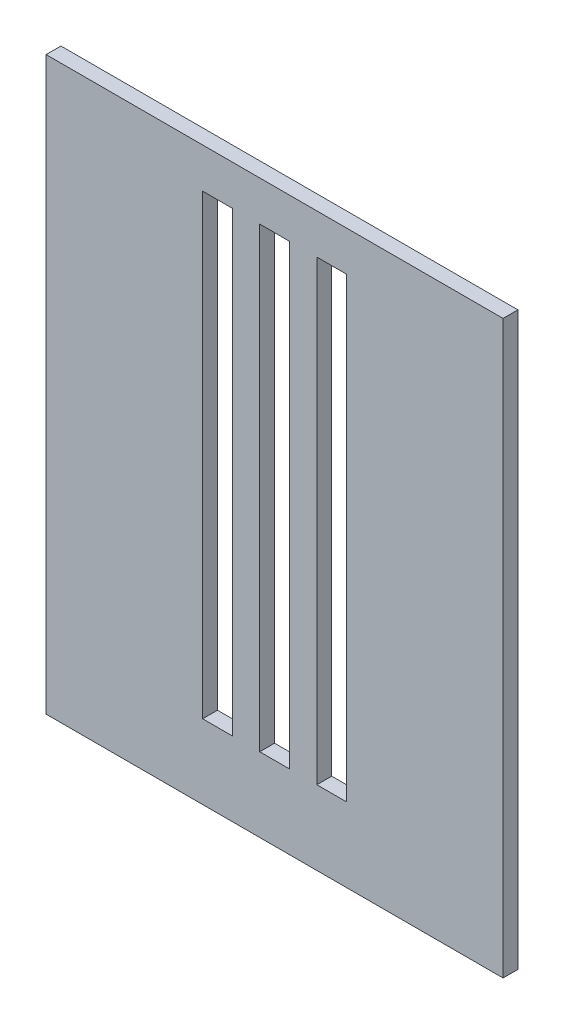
ISO-10303-21;
HEADER;
FILE_DESCRIPTION(('STEP AP214'),'2;1');
FILE_NAME('part.step','',(''),(''),'','','');
FILE_SCHEMA(('AUTOMOTIVE_DESIGN { 1 0 10303 214 1 1 1 1 }'));
ENDSEC;
DATA;
#1=APPLICATION_CONTEXT('core data for automotive mechanical design processes');
#2=APPLICATION_PROTOCOL_DEFINITION('international standard','automotive_design',2000,#1);
#3=PRODUCT_CONTEXT('',#1,'mechanical');
#4=PRODUCT('Part','Part','',(#3));
#5=PRODUCT_RELATED_PRODUCT_CATEGORY('part','',(#4));
#6=PRODUCT_DEFINITION_FORMATION('','',#4);
#7=PRODUCT_DEFINITION_CONTEXT('part definition',#1,'design');
#8=PRODUCT_DEFINITION('design','',#6,#7);
#9=PRODUCT_DEFINITION_SHAPE('','',#8);
#10=(LENGTH_UNIT() NAMED_UNIT(*) SI_UNIT(.MILLI.,.METRE.));
#11=(NAMED_UNIT(*) PLANE_ANGLE_UNIT() SI_UNIT($,.RADIAN.));
#12=(NAMED_UNIT(*) SI_UNIT($,.STERADIAN.) SOLID_ANGLE_UNIT());
#13=UNCERTAINTY_MEASURE_WITH_UNIT(LENGTH_MEASURE(1.E-05),#10,'distance_accuracy_value','');
#14=(GEOMETRIC_REPRESENTATION_CONTEXT(3) GLOBAL_UNCERTAINTY_ASSIGNED_CONTEXT((#13)) GLOBAL_UNIT_ASSIGNED_CONTEXT((#10,
#11,#12)) REPRESENTATION_CONTEXT('',''));
#15=CARTESIAN_POINT('',(0.,0.,0.));
#16=DIRECTION('',(0.,0.,1.));
#17=DIRECTION('',(1.,0.,0.));
#18=AXIS2_PLACEMENT_3D('',#15,#16,#17);
#19=CARTESIAN_POINT('',(-50.8,-31.75,-3.302));
#20=DIRECTION('',(1.,0.,0.));
#21=DIRECTION('',(0.,0.,1.));
#22=AXIS2_PLACEMENT_3D('',#19,#20,#21);
#23=PLANE('',#22);
#24=DIRECTION('',(0.,-1.,0.));
#25=VECTOR('',#24,1.);
#26=CARTESIAN_POINT('',(-50.8,-31.75,0.));
#27=LINE('',#26,#25);
#28=CARTESIAN_POINT('',(-50.8,95.25,0.));
#29=VERTEX_POINT('',#28);
#30=CARTESIAN_POINT('',(-50.8,-31.75,0.));
#31=VERTEX_POINT('',#30);
#32=EDGE_CURVE('E244',#29,#31,#27,.T.);
#33=ORIENTED_EDGE('',*,*,#32,.F.);
#34=DIRECTION('',(0.,0.,1.));
#35=VECTOR('',#34,1.);
#36=CARTESIAN_POINT('',(-50.8,95.25,-3.302));
#37=LINE('',#36,#35);
#38=CARTESIAN_POINT('',(-50.8,95.25,-3.302));
#39=VERTEX_POINT('',#38);
#40=EDGE_CURVE('E257',#39,#29,#37,.T.);
#41=ORIENTED_EDGE('',*,*,#40,.F.);
#42=DIRECTION('',(0.,-1.,0.));
#43=VECTOR('',#42,1.);
#44=CARTESIAN_POINT('',(-50.8,-31.75,-3.302));
#45=LINE('',#44,#43);
#46=CARTESIAN_POINT('',(-50.8,-31.75,-3.302));
#47=VERTEX_POINT('',#46);
#48=EDGE_CURVE('E245',#39,#47,#45,.T.);
#49=ORIENTED_EDGE('',*,*,#48,.T.);
#50=DIRECTION('',(0.,0.,1.));
#51=VECTOR('',#50,1.);
#52=CARTESIAN_POINT('',(-50.8,-31.75,-3.302));
#53=LINE('',#52,#51);
#54=EDGE_CURVE('E11',#47,#31,#53,.T.);
#55=ORIENTED_EDGE('',*,*,#54,.T.);
#56=EDGE_LOOP('',(#33,#41,#49,#55));
#57=FACE_BOUND('',#56,.T.);
#58=ADVANCED_FACE('F37',(#57),#23,.F.);
#59=CARTESIAN_POINT('',(-50.8,-31.75,-3.302));
#60=DIRECTION('',(0.,1.,0.));
#61=DIRECTION('',(0.,0.,-1.));
#62=AXIS2_PLACEMENT_3D('',#59,#60,#61);
#63=PLANE('',#62);
#64=DIRECTION('',(1.,0.,0.));
#65=VECTOR('',#64,1.);
#66=CARTESIAN_POINT('',(-50.8,-31.75,0.));
#67=LINE('',#66,#65);
#68=CARTESIAN_POINT('',(50.8,-31.75,0.));
#69=VERTEX_POINT('',#68);
#70=EDGE_CURVE('E260',#31,#69,#67,.T.);
#71=ORIENTED_EDGE('',*,*,#70,.F.);
#72=ORIENTED_EDGE('',*,*,#54,.F.);
#73=DIRECTION('',(1.,0.,0.));
#74=VECTOR('',#73,1.);
#75=CARTESIAN_POINT('',(-50.8,-31.75,-3.302));
#76=LINE('',#75,#74);
#77=CARTESIAN_POINT('',(50.8,-31.75,-3.302));
#78=VERTEX_POINT('',#77);
#79=EDGE_CURVE('E248',#47,#78,#76,.T.);
#80=ORIENTED_EDGE('',*,*,#79,.T.);
#81=DIRECTION('',(0.,0.,1.));
#82=VECTOR('',#81,1.);
#83=CARTESIAN_POINT('',(50.8,-31.75,-3.302));
#84=LINE('',#83,#82);
#85=EDGE_CURVE('E44',#78,#69,#84,.T.);
#86=ORIENTED_EDGE('',*,*,#85,.T.);
#87=EDGE_LOOP('',(#71,#72,#80,#86));
#88=FACE_BOUND('',#87,.T.);
#89=ADVANCED_FACE('F274',(#88),#63,.F.);
#90=CARTESIAN_POINT('',(50.8,-31.75,-3.302));
#91=DIRECTION('',(-1.,0.,0.));
#92=DIRECTION('',(0.,0.,-1.));
#93=AXIS2_PLACEMENT_3D('',#90,#91,#92);
#94=PLANE('',#93);
#95=DIRECTION('',(0.,1.,0.));
#96=VECTOR('',#95,1.);
#97=CARTESIAN_POINT('',(50.8,-31.75,0.));
#98=LINE('',#97,#96);
#99=CARTESIAN_POINT('',(50.8,95.25,0.));
#100=VERTEX_POINT('',#99);
#101=EDGE_CURVE('E263',#69,#100,#98,.T.);
#102=ORIENTED_EDGE('',*,*,#101,.F.);
#103=ORIENTED_EDGE('',*,*,#85,.F.);
#104=DIRECTION('',(0.,1.,0.));
#105=VECTOR('',#104,1.);
#106=CARTESIAN_POINT('',(50.8,-31.75,-3.302));
#107=LINE('',#106,#105);
#108=CARTESIAN_POINT('',(50.8,95.25,-3.302));
#109=VERTEX_POINT('',#108);
#110=EDGE_CURVE('E252',#78,#109,#107,.T.);
#111=ORIENTED_EDGE('',*,*,#110,.T.);
#112=DIRECTION('',(0.,0.,1.));
#113=VECTOR('',#112,1.);
#114=CARTESIAN_POINT('',(50.8,95.25,-3.302));
#115=LINE('',#114,#113);
#116=EDGE_CURVE('E269',#109,#100,#115,.T.);
#117=ORIENTED_EDGE('',*,*,#116,.T.);
#118=EDGE_LOOP('',(#102,#103,#111,#117));
#119=FACE_BOUND('',#118,.T.);
#120=ADVANCED_FACE('F285',(#119),#94,.F.);
#121=CARTESIAN_POINT('',(-50.8,95.25,-3.302));
#122=DIRECTION('',(0.,-1.,0.));
#123=DIRECTION('',(0.,0.,1.));
#124=AXIS2_PLACEMENT_3D('',#121,#122,#123);
#125=PLANE('',#124);
#126=DIRECTION('',(-1.,0.,0.));
#127=VECTOR('',#126,1.);
#128=CARTESIAN_POINT('',(-50.8,95.25,0.));
#129=LINE('',#128,#127);
#130=EDGE_CURVE('E249',#100,#29,#129,.T.);
#131=ORIENTED_EDGE('',*,*,#130,.F.);
#132=ORIENTED_EDGE('',*,*,#116,.F.);
#133=DIRECTION('',(-1.,0.,0.));
#134=VECTOR('',#133,1.);
#135=CARTESIAN_POINT('',(-50.8,95.25,-3.302));
#136=LINE('',#135,#134);
#137=EDGE_CURVE('E255',#109,#39,#136,.T.);
#138=ORIENTED_EDGE('',*,*,#137,.T.);
#139=ORIENTED_EDGE('',*,*,#40,.T.);
#140=EDGE_LOOP('',(#131,#132,#138,#139));
#141=FACE_BOUND('',#140,.T.);
#142=ADVANCED_FACE('F287',(#141),#125,.F.);
#143=CARTESIAN_POINT('',(0.,0.,-3.302));
#144=DIRECTION('',(0.,0.,1.));
#145=DIRECTION('',(-1.,0.,0.));
#146=AXIS2_PLACEMENT_3D('',#143,#144,#145);
#147=PLANE('',#146);
#148=DIRECTION('',(0.,-1.,0.));
#149=VECTOR('',#148,1.);
#150=CARTESIAN_POINT('',(9.39799999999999,86.36,-3.302));
#151=LINE('',#150,#149);
#152=CARTESIAN_POINT('',(9.39799999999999,86.36,-3.302));
#153=VERTEX_POINT('',#152);
#154=CARTESIAN_POINT('',(9.39800000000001,-15.24,-3.302));
#155=VERTEX_POINT('',#154);
#156=EDGE_CURVE('E188',#153,#155,#151,.T.);
#157=ORIENTED_EDGE('',*,*,#156,.T.);
#158=DIRECTION('',(1.,0.,0.));
#159=VECTOR('',#158,1.);
#160=CARTESIAN_POINT('',(9.39800000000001,-15.24,-3.302));
#161=LINE('',#160,#159);
#162=CARTESIAN_POINT('',(16.002,-15.24,-3.302));
#163=VERTEX_POINT('',#162);
#164=EDGE_CURVE('E185',#155,#163,#161,.T.);
#165=ORIENTED_EDGE('',*,*,#164,.T.);
#166=DIRECTION('',(0.,1.,0.));
#167=VECTOR('',#166,1.);
#168=CARTESIAN_POINT('',(16.002,86.36,-3.302));
#169=LINE('',#168,#167);
#170=CARTESIAN_POINT('',(16.002,86.36,-3.302));
#171=VERTEX_POINT('',#170);
#172=EDGE_CURVE('E209',#163,#171,#169,.T.);
#173=ORIENTED_EDGE('',*,*,#172,.T.);
#174=DIRECTION('',(-1.,0.,0.));
#175=VECTOR('',#174,1.);
#176=CARTESIAN_POINT('',(9.39799999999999,86.36,-3.302));
#177=LINE('',#176,#175);
#178=EDGE_CURVE('E191',#171,#153,#177,.T.);
#179=ORIENTED_EDGE('',*,*,#178,.T.);
#180=EDGE_LOOP('',(#157,#165,#173,#179));
#181=FACE_BOUND('',#180,.T.);
#182=DIRECTION('',(-1.,0.,0.));
#183=VECTOR('',#182,1.);
#184=CARTESIAN_POINT('',(-9.39799999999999,86.36,-3.302));
#185=LINE('',#184,#183);
#186=CARTESIAN_POINT('',(-9.39799999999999,86.36,-3.302));
#187=VERTEX_POINT('',#186);
#188=CARTESIAN_POINT('',(-16.002,86.36,-3.302));
#189=VERTEX_POINT('',#188);
#190=EDGE_CURVE('E171',#187,#189,#185,.T.);
#191=ORIENTED_EDGE('',*,*,#190,.T.);
#192=DIRECTION('',(0.,-1.,0.));
#193=VECTOR('',#192,1.);
#194=CARTESIAN_POINT('',(-16.002,86.36,-3.302));
#195=LINE('',#194,#193);
#196=CARTESIAN_POINT('',(-16.002,-15.24,-3.302));
#197=VERTEX_POINT('',#196);
#198=EDGE_CURVE('E175',#189,#197,#195,.T.);
#199=ORIENTED_EDGE('',*,*,#198,.T.);
#200=DIRECTION('',(1.,0.,0.));
#201=VECTOR('',#200,1.);
#202=CARTESIAN_POINT('',(-9.39800000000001,-15.24,-3.302));
#203=LINE('',#202,#201);
#204=CARTESIAN_POINT('',(-9.39800000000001,-15.24,-3.302));
#205=VERTEX_POINT('',#204);
#206=EDGE_CURVE('E154',#197,#205,#203,.T.);
#207=ORIENTED_EDGE('',*,*,#206,.T.);
#208=DIRECTION('',(0.,1.,0.));
#209=VECTOR('',#208,1.);
#210=CARTESIAN_POINT('',(-9.39799999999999,86.36,-3.302));
#211=LINE('',#210,#209);
#212=EDGE_CURVE('E164',#205,#187,#211,.T.);
#213=ORIENTED_EDGE('',*,*,#212,.T.);
#214=EDGE_LOOP('',(#191,#199,#207,#213));
#215=FACE_BOUND('',#214,.T.);
#216=DIRECTION('',(-1.,0.,0.));
#217=VECTOR('',#216,1.);
#218=CARTESIAN_POINT('',(3.302,86.36,-3.302));
#219=LINE('',#218,#217);
#220=CARTESIAN_POINT('',(3.302,86.36,-3.302));
#221=VERTEX_POINT('',#220);
#222=CARTESIAN_POINT('',(-3.30199999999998,86.36,-3.302));
#223=VERTEX_POINT('',#222);
#224=EDGE_CURVE('E179',#221,#223,#219,.T.);
#225=ORIENTED_EDGE('',*,*,#224,.T.);
#226=DIRECTION('',(0.,-1.,0.));
#227=VECTOR('',#226,1.);
#228=CARTESIAN_POINT('',(-3.30199999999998,86.36,-3.302));
#229=LINE('',#228,#227);
#230=CARTESIAN_POINT('',(-3.30200000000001,-15.24,-3.302));
#231=VERTEX_POINT('',#230);
#232=EDGE_CURVE('E176',#223,#231,#229,.T.);
#233=ORIENTED_EDGE('',*,*,#232,.T.);
#234=DIRECTION('',(1.,0.,0.));
#235=VECTOR('',#234,1.);
#236=CARTESIAN_POINT('',(3.30199999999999,-15.24,-3.302));
#237=LINE('',#236,#235);
#238=CARTESIAN_POINT('',(3.30199999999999,-15.24,-3.302));
#239=VERTEX_POINT('',#238);
#240=EDGE_CURVE('E236',#231,#239,#237,.T.);
#241=ORIENTED_EDGE('',*,*,#240,.T.);
#242=DIRECTION('',(0.,1.,0.));
#243=VECTOR('',#242,1.);
#244=CARTESIAN_POINT('',(3.302,86.36,-3.302));
#245=LINE('',#244,#243);
#246=EDGE_CURVE('E218',#239,#221,#245,.T.);
#247=ORIENTED_EDGE('',*,*,#246,.T.);
#248=EDGE_LOOP('',(#225,#233,#241,#247));
#249=FACE_BOUND('',#248,.T.);
#250=ORIENTED_EDGE('',*,*,#48,.F.);
#251=ORIENTED_EDGE('',*,*,#137,.F.);
#252=ORIENTED_EDGE('',*,*,#110,.F.);
#253=ORIENTED_EDGE('',*,*,#79,.F.);
#254=EDGE_LOOP('',(#250,#251,#252,#253));
#255=FACE_BOUND('',#254,.T.);
#256=ADVANCED_FACE('F173',(#181,#215,#249,#255),#147,.F.);
#257=CARTESIAN_POINT('',(0.,0.,0.));
#258=DIRECTION('',(0.,0.,1.));
#259=DIRECTION('',(-1.,0.,0.));
#260=AXIS2_PLACEMENT_3D('',#257,#258,#259);
#261=PLANE('',#260);
#262=DIRECTION('',(1.,0.,0.));
#263=VECTOR('',#262,1.);
#264=CARTESIAN_POINT('',(9.39799999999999,86.36,0.));
#265=LINE('',#264,#263);
#266=CARTESIAN_POINT('',(9.39799999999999,86.36,0.));
#267=VERTEX_POINT('',#266);
#268=CARTESIAN_POINT('',(16.002,86.36,0.));
#269=VERTEX_POINT('',#268);
#270=EDGE_CURVE('E194',#267,#269,#265,.T.);
#271=ORIENTED_EDGE('',*,*,#270,.T.);
#272=DIRECTION('',(0.,-1.,0.));
#273=VECTOR('',#272,1.);
#274=CARTESIAN_POINT('',(16.002,86.36,0.));
#275=LINE('',#274,#273);
#276=CARTESIAN_POINT('',(16.002,-15.24,0.));
#277=VERTEX_POINT('',#276);
#278=EDGE_CURVE('E197',#269,#277,#275,.T.);
#279=ORIENTED_EDGE('',*,*,#278,.T.);
#280=DIRECTION('',(-1.,0.,0.));
#281=VECTOR('',#280,1.);
#282=CARTESIAN_POINT('',(9.39800000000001,-15.24,0.));
#283=LINE('',#282,#281);
#284=CARTESIAN_POINT('',(9.39800000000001,-15.24,0.));
#285=VERTEX_POINT('',#284);
#286=EDGE_CURVE('E200',#277,#285,#283,.T.);
#287=ORIENTED_EDGE('',*,*,#286,.T.);
#288=DIRECTION('',(0.,1.,0.));
#289=VECTOR('',#288,1.);
#290=CARTESIAN_POINT('',(9.39799999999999,86.36,0.));
#291=LINE('',#290,#289);
#292=EDGE_CURVE('E203',#285,#267,#291,.T.);
#293=ORIENTED_EDGE('',*,*,#292,.T.);
#294=EDGE_LOOP('',(#271,#279,#287,#293));
#295=FACE_BOUND('',#294,.T.);
#296=DIRECTION('',(0.,-1.,0.));
#297=VECTOR('',#296,1.);
#298=CARTESIAN_POINT('',(-9.39799999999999,86.36,0.));
#299=LINE('',#298,#297);
#300=CARTESIAN_POINT('',(-9.39799999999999,86.36,0.));
#301=VERTEX_POINT('',#300);
#302=CARTESIAN_POINT('',(-9.39800000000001,-15.24,0.));
#303=VERTEX_POINT('',#302);
#304=EDGE_CURVE('E170',#301,#303,#299,.T.);
#305=ORIENTED_EDGE('',*,*,#304,.T.);
#306=DIRECTION('',(-1.,0.,0.));
#307=VECTOR('',#306,1.);
#308=CARTESIAN_POINT('',(-9.39800000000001,-15.24,0.));
#309=LINE('',#308,#307);
#310=CARTESIAN_POINT('',(-16.002,-15.24,0.));
#311=VERTEX_POINT('',#310);
#312=EDGE_CURVE('E157',#303,#311,#309,.T.);
#313=ORIENTED_EDGE('',*,*,#312,.T.);
#314=DIRECTION('',(0.,1.,0.));
#315=VECTOR('',#314,1.);
#316=CARTESIAN_POINT('',(-16.002,86.36,0.));
#317=LINE('',#316,#315);
#318=CARTESIAN_POINT('',(-16.002,86.36,0.));
#319=VERTEX_POINT('',#318);
#320=EDGE_CURVE('E463',#311,#319,#317,.T.);
#321=ORIENTED_EDGE('',*,*,#320,.T.);
#322=DIRECTION('',(1.,0.,0.));
#323=VECTOR('',#322,1.);
#324=CARTESIAN_POINT('',(-9.39799999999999,86.36,0.));
#325=LINE('',#324,#323);
#326=EDGE_CURVE('E161',#319,#301,#325,.T.);
#327=ORIENTED_EDGE('',*,*,#326,.T.);
#328=EDGE_LOOP('',(#305,#313,#321,#327));
#329=FACE_BOUND('',#328,.T.);
#330=DIRECTION('',(0.,-1.,0.));
#331=VECTOR('',#330,1.);
#332=CARTESIAN_POINT('',(3.302,86.36,0.));
#333=LINE('',#332,#331);
#334=CARTESIAN_POINT('',(3.302,86.36,0.));
#335=VERTEX_POINT('',#334);
#336=CARTESIAN_POINT('',(3.30199999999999,-15.24,0.));
#337=VERTEX_POINT('',#336);
#338=EDGE_CURVE('E221',#335,#337,#333,.T.);
#339=ORIENTED_EDGE('',*,*,#338,.T.);
#340=DIRECTION('',(-1.,0.,0.));
#341=VECTOR('',#340,1.);
#342=CARTESIAN_POINT('',(3.30199999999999,-15.24,0.));
#343=LINE('',#342,#341);
#344=CARTESIAN_POINT('',(-3.30200000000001,-15.24,0.));
#345=VERTEX_POINT('',#344);
#346=EDGE_CURVE('E224',#337,#345,#343,.T.);
#347=ORIENTED_EDGE('',*,*,#346,.T.);
#348=DIRECTION('',(0.,1.,0.));
#349=VECTOR('',#348,1.);
#350=CARTESIAN_POINT('',(-3.30199999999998,86.36,0.));
#351=LINE('',#350,#349);
#352=CARTESIAN_POINT('',(-3.30199999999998,86.36,0.));
#353=VERTEX_POINT('',#352);
#354=EDGE_CURVE('E227',#345,#353,#351,.T.);
#355=ORIENTED_EDGE('',*,*,#354,.T.);
#356=DIRECTION('',(1.,0.,0.));
#357=VECTOR('',#356,1.);
#358=CARTESIAN_POINT('',(3.302,86.36,0.));
#359=LINE('',#358,#357);
#360=EDGE_CURVE('E230',#353,#335,#359,.T.);
#361=ORIENTED_EDGE('',*,*,#360,.T.);
#362=EDGE_LOOP('',(#339,#347,#355,#361));
#363=FACE_BOUND('',#362,.T.);
#364=ORIENTED_EDGE('',*,*,#32,.T.);
#365=ORIENTED_EDGE('',*,*,#70,.T.);
#366=ORIENTED_EDGE('',*,*,#101,.T.);
#367=ORIENTED_EDGE('',*,*,#130,.T.);
#368=EDGE_LOOP('',(#364,#365,#366,#367));
#369=FACE_BOUND('',#368,.T.);
#370=ADVANCED_FACE('F278',(#295,#329,#363,#369),#261,.T.);
#371=CARTESIAN_POINT('',(3.302,86.36,-3.303));
#372=DIRECTION('',(1.,0.,0.));
#373=DIRECTION('',(0.,1.,0.));
#374=AXIS2_PLACEMENT_3D('',#371,#372,#373);
#375=PLANE('',#374);
#376=ORIENTED_EDGE('',*,*,#246,.F.);
#377=DIRECTION('',(0.,0.,1.));
#378=VECTOR('',#377,1.);
#379=CARTESIAN_POINT('',(3.30199999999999,-15.24,-3.303));
#380=LINE('',#379,#378);
#381=EDGE_CURVE('E233',#239,#337,#380,.T.);
#382=ORIENTED_EDGE('',*,*,#381,.T.);
#383=ORIENTED_EDGE('',*,*,#338,.F.);
#384=DIRECTION('',(0.,0.,1.));
#385=VECTOR('',#384,1.);
#386=CARTESIAN_POINT('',(3.302,86.36,-3.303));
#387=LINE('',#386,#385);
#388=EDGE_CURVE('E234',#221,#335,#387,.T.);
#389=ORIENTED_EDGE('',*,*,#388,.F.);
#390=EDGE_LOOP('',(#376,#382,#383,#389));
#391=FACE_BOUND('',#390,.T.);
#392=ADVANCED_FACE('F327',(#391),#375,.F.);
#393=CARTESIAN_POINT('',(3.302,86.36,-3.303));
#394=DIRECTION('',(0.,1.,0.));
#395=DIRECTION('',(0.,0.,-1.));
#396=AXIS2_PLACEMENT_3D('',#393,#394,#395);
#397=PLANE('',#396);
#398=ORIENTED_EDGE('',*,*,#224,.F.);
#399=ORIENTED_EDGE('',*,*,#388,.T.);
#400=ORIENTED_EDGE('',*,*,#360,.F.);
#401=DIRECTION('',(0.,0.,1.));
#402=VECTOR('',#401,1.);
#403=CARTESIAN_POINT('',(-3.30199999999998,86.36,-3.303));
#404=LINE('',#403,#402);
#405=EDGE_CURVE('E237',#223,#353,#404,.T.);
#406=ORIENTED_EDGE('',*,*,#405,.F.);
#407=EDGE_LOOP('',(#398,#399,#400,#406));
#408=FACE_BOUND('',#407,.T.);
#409=ADVANCED_FACE('F336',(#408),#397,.F.);
#410=CARTESIAN_POINT('',(-3.30199999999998,86.36,-3.303));
#411=DIRECTION('',(-1.,0.,0.));
#412=DIRECTION('',(0.,-1.,0.));
#413=AXIS2_PLACEMENT_3D('',#410,#411,#412);
#414=PLANE('',#413);
#415=ORIENTED_EDGE('',*,*,#232,.F.);
#416=ORIENTED_EDGE('',*,*,#405,.T.);
#417=ORIENTED_EDGE('',*,*,#354,.F.);
#418=DIRECTION('',(0.,0.,1.));
#419=VECTOR('',#418,1.);
#420=CARTESIAN_POINT('',(-3.30200000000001,-15.24,-3.303));
#421=LINE('',#420,#419);
#422=EDGE_CURVE('E239',#231,#345,#421,.T.);
#423=ORIENTED_EDGE('',*,*,#422,.F.);
#424=EDGE_LOOP('',(#415,#416,#417,#423));
#425=FACE_BOUND('',#424,.T.);
#426=ADVANCED_FACE('F346',(#425),#414,.F.);
#427=CARTESIAN_POINT('',(3.30199999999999,-15.24,-3.303));
#428=DIRECTION('',(0.,-1.,0.));
#429=DIRECTION('',(1.,0.,0.));
#430=AXIS2_PLACEMENT_3D('',#427,#428,#429);
#431=PLANE('',#430);
#432=ORIENTED_EDGE('',*,*,#240,.F.);
#433=ORIENTED_EDGE('',*,*,#422,.T.);
#434=ORIENTED_EDGE('',*,*,#346,.F.);
#435=ORIENTED_EDGE('',*,*,#381,.F.);
#436=EDGE_LOOP('',(#432,#433,#434,#435));
#437=FACE_BOUND('',#436,.T.);
#438=ADVANCED_FACE('F356',(#437),#431,.F.);
#439=CARTESIAN_POINT('',(-9.39799999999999,86.36,-3.303));
#440=DIRECTION('',(1.,0.,0.));
#441=DIRECTION('',(0.,1.,0.));
#442=AXIS2_PLACEMENT_3D('',#439,#440,#441);
#443=PLANE('',#442);
#444=ORIENTED_EDGE('',*,*,#212,.F.);
#445=DIRECTION('',(0.,0.,1.));
#446=VECTOR('',#445,1.);
#447=CARTESIAN_POINT('',(-9.39800000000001,-15.24,-3.303));
#448=LINE('',#447,#446);
#449=EDGE_CURVE('E150',#205,#303,#448,.T.);
#450=ORIENTED_EDGE('',*,*,#449,.T.);
#451=ORIENTED_EDGE('',*,*,#304,.F.);
#452=DIRECTION('',(0.,0.,1.));
#453=VECTOR('',#452,1.);
#454=CARTESIAN_POINT('',(-9.39799999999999,86.36,-3.303));
#455=LINE('',#454,#453);
#456=EDGE_CURVE('E166',#187,#301,#455,.T.);
#457=ORIENTED_EDGE('',*,*,#456,.F.);
#458=EDGE_LOOP('',(#444,#450,#451,#457));
#459=FACE_BOUND('',#458,.T.);
#460=ADVANCED_FACE('F165',(#459),#443,.F.);
#461=CARTESIAN_POINT('',(-9.39799999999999,86.36,-3.303));
#462=DIRECTION('',(0.,1.,0.));
#463=DIRECTION('',(0.,0.,-1.));
#464=AXIS2_PLACEMENT_3D('',#461,#462,#463);
#465=PLANE('',#464);
#466=ORIENTED_EDGE('',*,*,#190,.F.);
#467=ORIENTED_EDGE('',*,*,#456,.T.);
#468=ORIENTED_EDGE('',*,*,#326,.F.);
#469=DIRECTION('',(0.,0.,1.));
#470=VECTOR('',#469,1.);
#471=CARTESIAN_POINT('',(-16.002,86.36,-3.303));
#472=LINE('',#471,#470);
#473=EDGE_CURVE('E181',#189,#319,#472,.T.);
#474=ORIENTED_EDGE('',*,*,#473,.F.);
#475=EDGE_LOOP('',(#466,#467,#468,#474));
#476=FACE_BOUND('',#475,.T.);
#477=ADVANCED_FACE('F375',(#476),#465,.F.);
#478=CARTESIAN_POINT('',(-16.002,86.36,-3.303));
#479=DIRECTION('',(-1.,0.,0.));
#480=DIRECTION('',(0.,-1.,0.));
#481=AXIS2_PLACEMENT_3D('',#478,#479,#480);
#482=PLANE('',#481);
#483=ORIENTED_EDGE('',*,*,#198,.F.);
#484=ORIENTED_EDGE('',*,*,#473,.T.);
#485=ORIENTED_EDGE('',*,*,#320,.F.);
#486=DIRECTION('',(0.,0.,1.));
#487=VECTOR('',#486,1.);
#488=CARTESIAN_POINT('',(-16.002,-15.24,-3.303));
#489=LINE('',#488,#487);
#490=EDGE_CURVE('E59',#197,#311,#489,.T.);
#491=ORIENTED_EDGE('',*,*,#490,.F.);
#492=EDGE_LOOP('',(#483,#484,#485,#491));
#493=FACE_BOUND('',#492,.T.);
#494=ADVANCED_FACE('F384',(#493),#482,.F.);
#495=CARTESIAN_POINT('',(-9.39800000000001,-15.24,-3.303));
#496=DIRECTION('',(0.,-1.,0.));
#497=DIRECTION('',(1.,0.,0.));
#498=AXIS2_PLACEMENT_3D('',#495,#496,#497);
#499=PLANE('',#498);
#500=ORIENTED_EDGE('',*,*,#206,.F.);
#501=ORIENTED_EDGE('',*,*,#490,.T.);
#502=ORIENTED_EDGE('',*,*,#312,.F.);
#503=ORIENTED_EDGE('',*,*,#449,.F.);
#504=EDGE_LOOP('',(#500,#501,#502,#503));
#505=FACE_BOUND('',#504,.T.);
#506=ADVANCED_FACE('F152',(#505),#499,.F.);
#507=CARTESIAN_POINT('',(9.39799999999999,86.36,-3.303));
#508=DIRECTION('',(0.,1.,0.));
#509=DIRECTION('',(0.,0.,-1.));
#510=AXIS2_PLACEMENT_3D('',#507,#508,#509);
#511=PLANE('',#510);
#512=ORIENTED_EDGE('',*,*,#178,.F.);
#513=DIRECTION('',(0.,0.,1.));
#514=VECTOR('',#513,1.);
#515=CARTESIAN_POINT('',(16.002,86.36,-3.303));
#516=LINE('',#515,#514);
#517=EDGE_CURVE('E206',#171,#269,#516,.T.);
#518=ORIENTED_EDGE('',*,*,#517,.T.);
#519=ORIENTED_EDGE('',*,*,#270,.F.);
#520=DIRECTION('',(0.,0.,1.));
#521=VECTOR('',#520,1.);
#522=CARTESIAN_POINT('',(9.39799999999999,86.36,-3.303));
#523=LINE('',#522,#521);
#524=EDGE_CURVE('E207',#153,#267,#523,.T.);
#525=ORIENTED_EDGE('',*,*,#524,.F.);
#526=EDGE_LOOP('',(#512,#518,#519,#525));
#527=FACE_BOUND('',#526,.T.);
#528=ADVANCED_FACE('F402',(#527),#511,.F.);
#529=CARTESIAN_POINT('',(9.39799999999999,86.36,-3.303));
#530=DIRECTION('',(-1.,0.,0.));
#531=DIRECTION('',(0.,-1.,0.));
#532=AXIS2_PLACEMENT_3D('',#529,#530,#531);
#533=PLANE('',#532);
#534=ORIENTED_EDGE('',*,*,#156,.F.);
#535=ORIENTED_EDGE('',*,*,#524,.T.);
#536=ORIENTED_EDGE('',*,*,#292,.F.);
#537=DIRECTION('',(0.,0.,1.));
#538=VECTOR('',#537,1.);
#539=CARTESIAN_POINT('',(9.39800000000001,-15.24,-3.303));
#540=LINE('',#539,#538);
#541=EDGE_CURVE('E210',#155,#285,#540,.T.);
#542=ORIENTED_EDGE('',*,*,#541,.F.);
#543=EDGE_LOOP('',(#534,#535,#536,#542));
#544=FACE_BOUND('',#543,.T.);
#545=ADVANCED_FACE('F411',(#544),#533,.F.);
#546=CARTESIAN_POINT('',(9.39800000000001,-15.24,-3.303));
#547=DIRECTION('',(0.,-1.,0.));
#548=DIRECTION('',(1.,0.,0.));
#549=AXIS2_PLACEMENT_3D('',#546,#547,#548);
#550=PLANE('',#549);
#551=ORIENTED_EDGE('',*,*,#164,.F.);
#552=ORIENTED_EDGE('',*,*,#541,.T.);
#553=ORIENTED_EDGE('',*,*,#286,.F.);
#554=DIRECTION('',(0.,0.,1.));
#555=VECTOR('',#554,1.);
#556=CARTESIAN_POINT('',(16.002,-15.24,-3.303));
#557=LINE('',#556,#555);
#558=EDGE_CURVE('E51',#163,#277,#557,.T.);
#559=ORIENTED_EDGE('',*,*,#558,.F.);
#560=EDGE_LOOP('',(#551,#552,#553,#559));
#561=FACE_BOUND('',#560,.T.);
#562=ADVANCED_FACE('F421',(#561),#550,.F.);
#563=CARTESIAN_POINT('',(16.002,86.36,-3.303));
#564=DIRECTION('',(1.,0.,0.));
#565=DIRECTION('',(0.,1.,0.));
#566=AXIS2_PLACEMENT_3D('',#563,#564,#565);
#567=PLANE('',#566);
#568=ORIENTED_EDGE('',*,*,#172,.F.);
#569=ORIENTED_EDGE('',*,*,#558,.T.);
#570=ORIENTED_EDGE('',*,*,#278,.F.);
#571=ORIENTED_EDGE('',*,*,#517,.F.);
#572=EDGE_LOOP('',(#568,#569,#570,#571));
#573=FACE_BOUND('',#572,.T.);
#574=ADVANCED_FACE('F431',(#573),#567,.F.);
#575=CLOSED_SHELL('',(#58,#89,#120,#142,#256,#370,#392,#409,#426,#438,#460,#477,#494,#506,#528,
#545,#562,#574));
#576=MANIFOLD_SOLID_BREP('B2',#575);
#577=ADVANCED_BREP_SHAPE_REPRESENTATION('',(#18,#576),#14);
#578=SHAPE_DEFINITION_REPRESENTATION(#9,#577);
ENDSEC;
END-ISO-10303-21;
